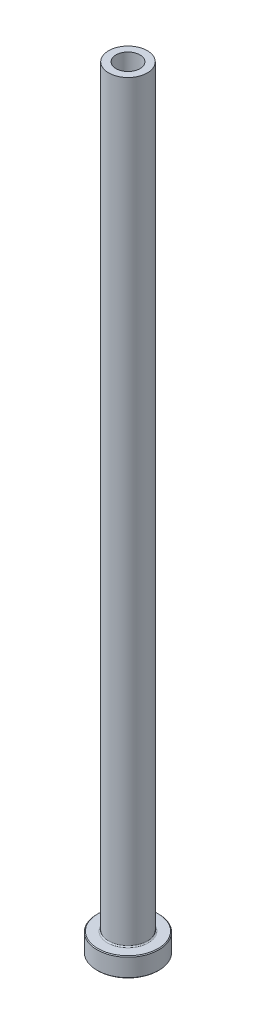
from build123d import *

# Parameters (mm, degrees)
FILLET1_R     = 0.3
CHAMFER1_SIZE = 0.2
CHAMFER3_SIZE = 0.5


with BuildPart() as part:
    # Sketch1 → Revolve1 (revolve)
    with BuildSketch(Plane.XY, mode=Mode.PRIVATE) as revolve1_sk:
        Polygon((-3.1, 200), (-5, 200), (-5, 5), (-8, 5), (-8, 0), (-3.35, 0), (-3.35, 143), (-3.1, 155), align=None)
    revolve(revolve1_sk.sketch.rotate(Axis((0, 92.187680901, 0), (0, -1, 0)), 270), axis=Axis((0, 92.187680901, 0), (0, -1, 0)))

    # Fillet1
    fillet1_edges = [part.edges().sort_by_distance(p)[0] for p in [
        (0, 5, -5),
    ]]
    fillet(fillet1_edges, radius=FILLET1_R)

    # Chamfer1
    chamfer1_edges = [part.edges().sort_by_distance(p)[0] for p in [
        (0, 0, -8),
        (0, 5, -8),
    ]]
    chamfer(chamfer1_edges, length=CHAMFER1_SIZE)

    # Chamfer3
    chamfer3_edges = [part.edges().sort_by_distance(p)[0] for p in [
        (0, 0, -3.35),
    ]]
    chamfer(chamfer3_edges, length=CHAMFER3_SIZE)


solid = part.part
